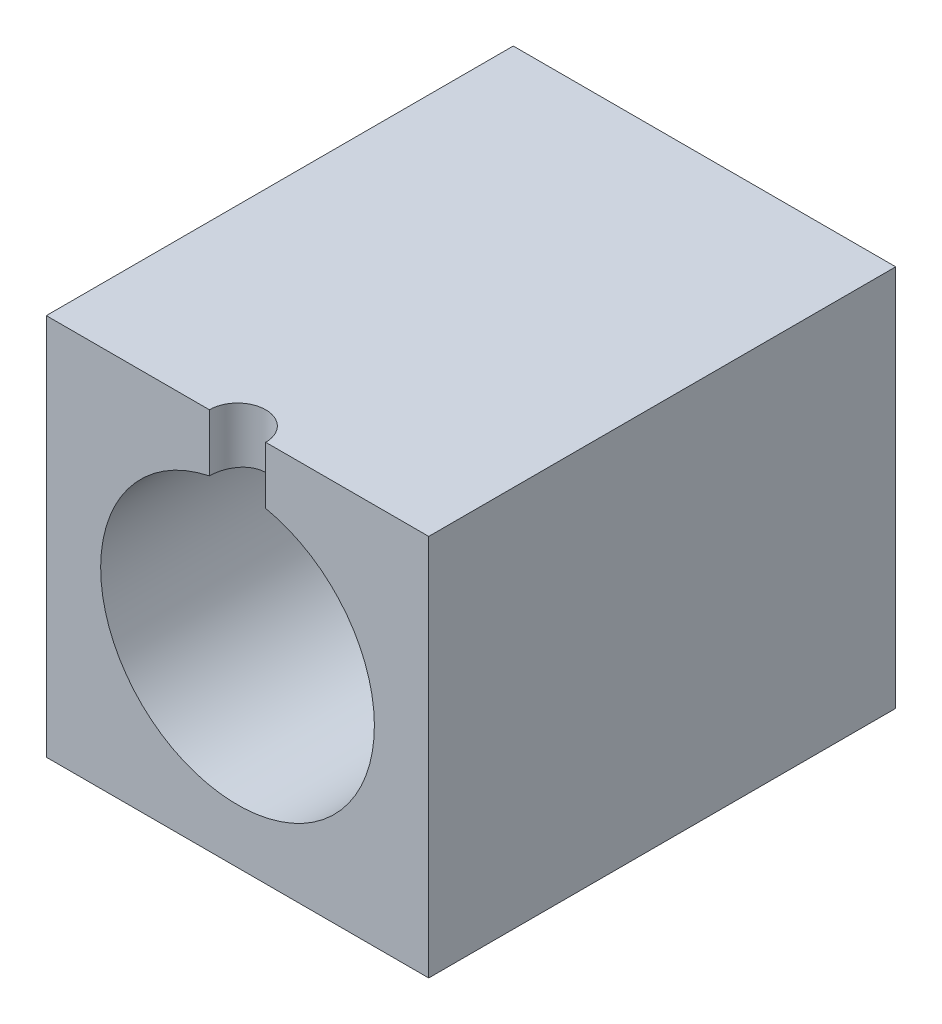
from build123d import *

# Parameters (mm, degrees)
SKETCH1_W               = 47.5
SKETCH1_H               = 47.5
SKETCH1_R               = 18.672898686
BOSS_EXTRUDE1_DEPTH     = 19
SKETCH2_W               = 47.5
SKETCH2_H               = 47.5
SKETCH2_R               = 17
BOSS_EXTRUDE2_DEPTH     = 39
CUT_EXTRUDE1_DEPTH      = 5
CUT_EXTRUDE1_DEPTH_BACK = 14
SKETCH3_R               = 3.5


with BuildPart() as part:
    # Sketch1 → Boss-Extrude1 (new body)
    with BuildSketch(Plane.XY):
        with Locations((-14.194915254, -7.786016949)):
            Rectangle(SKETCH1_W, SKETCH1_H)
        with Locations((-14.194915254, -7.786016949)):
            Circle(SKETCH1_R, mode=Mode.SUBTRACT)
    extrude(amount=BOSS_EXTRUDE1_DEPTH)

    # Sketch2 → Boss-Extrude2 (add)
    with BuildSketch(Plane.XY.offset(19)):
        with Locations((-14.194915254, -7.786016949)):
            Rectangle(SKETCH2_W, SKETCH2_H)
        with Locations((-14.194915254, -7.786016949)):
            Circle(SKETCH2_R, mode=Mode.SUBTRACT)
    extrude(amount=BOSS_EXTRUDE2_DEPTH)

    # Sketch3 → Cut-Extrude1 (cut, two sides: drawn at the far end of the back side and taken through both)
    with BuildSketch(Plane(origin=(0, 15.963983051, 0), x_dir=(1, 0, 0), z_dir=(0, 1, 0)).offset(-CUT_EXTRUDE1_DEPTH_BACK)):
        with Locations((-14.194915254, -58)):
            Circle(SKETCH3_R)
    extrude(amount=CUT_EXTRUDE1_DEPTH + CUT_EXTRUDE1_DEPTH_BACK, mode=Mode.SUBTRACT)


solid = part.part
